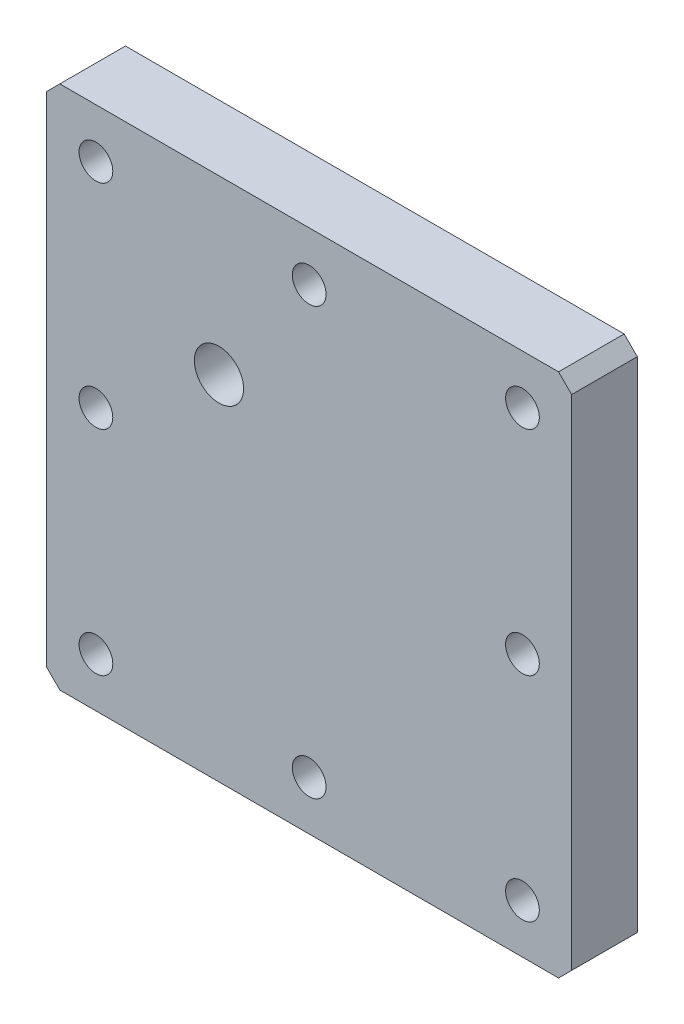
ISO-10303-21;
HEADER;
FILE_DESCRIPTION(('STEP AP214'),'2;1');
FILE_NAME('part.step','',(''),(''),'','','');
FILE_SCHEMA(('AUTOMOTIVE_DESIGN { 1 0 10303 214 1 1 1 1 }'));
ENDSEC;
DATA;
#1=APPLICATION_CONTEXT('core data for automotive mechanical design processes');
#2=APPLICATION_PROTOCOL_DEFINITION('international standard','automotive_design',2000,#1);
#3=PRODUCT_CONTEXT('',#1,'mechanical');
#4=PRODUCT('Part','Part','',(#3));
#5=PRODUCT_RELATED_PRODUCT_CATEGORY('part','',(#4));
#6=PRODUCT_DEFINITION_FORMATION('','',#4);
#7=PRODUCT_DEFINITION_CONTEXT('part definition',#1,'design');
#8=PRODUCT_DEFINITION('design','',#6,#7);
#9=PRODUCT_DEFINITION_SHAPE('','',#8);
#10=(LENGTH_UNIT() NAMED_UNIT(*) SI_UNIT(.MILLI.,.METRE.));
#11=(NAMED_UNIT(*) PLANE_ANGLE_UNIT() SI_UNIT($,.RADIAN.));
#12=(NAMED_UNIT(*) SI_UNIT($,.STERADIAN.) SOLID_ANGLE_UNIT());
#13=UNCERTAINTY_MEASURE_WITH_UNIT(LENGTH_MEASURE(1.E-05),#10,'distance_accuracy_value','');
#14=(GEOMETRIC_REPRESENTATION_CONTEXT(3) GLOBAL_UNCERTAINTY_ASSIGNED_CONTEXT((#13)) GLOBAL_UNIT_ASSIGNED_CONTEXT((#10,
#11,#12)) REPRESENTATION_CONTEXT('',''));
#15=CARTESIAN_POINT('',(0.,0.,0.));
#16=DIRECTION('',(0.,0.,1.));
#17=DIRECTION('',(1.,0.,0.));
#18=AXIS2_PLACEMENT_3D('',#15,#16,#17);
#19=CARTESIAN_POINT('',(-50.8,0.,12.7));
#20=DIRECTION('',(-1.,0.,0.));
#21=DIRECTION('',(0.,0.,1.));
#22=AXIS2_PLACEMENT_3D('',#19,#20,#21);
#23=PLANE('',#22);
#24=DIRECTION('',(0.,1.,0.));
#25=VECTOR('',#24,1.);
#26=CARTESIAN_POINT('',(-50.8,0.,0.));
#27=LINE('',#26,#25);
#28=CARTESIAN_POINT('',(-50.8,-48.26,0.));
#29=VERTEX_POINT('',#28);
#30=CARTESIAN_POINT('',(-50.8,48.26,0.));
#31=VERTEX_POINT('',#30);
#32=EDGE_CURVE('E159',#29,#31,#27,.T.);
#33=ORIENTED_EDGE('',*,*,#32,.F.);
#34=DIRECTION('',(0.,0.,-1.));
#35=VECTOR('',#34,1.);
#36=CARTESIAN_POINT('',(-50.8,-48.26,12.7));
#37=LINE('',#36,#35);
#38=CARTESIAN_POINT('',(-50.8,-48.26,12.7));
#39=VERTEX_POINT('',#38);
#40=EDGE_CURVE('E11',#39,#29,#37,.T.);
#41=ORIENTED_EDGE('',*,*,#40,.F.);
#42=DIRECTION('',(0.,1.,0.));
#43=VECTOR('',#42,1.);
#44=CARTESIAN_POINT('',(-50.8,0.,12.7));
#45=LINE('',#44,#43);
#46=CARTESIAN_POINT('',(-50.8,48.26,12.7));
#47=VERTEX_POINT('',#46);
#48=EDGE_CURVE('E453',#39,#47,#45,.T.);
#49=ORIENTED_EDGE('',*,*,#48,.T.);
#50=DIRECTION('',(0.,0.,-1.));
#51=VECTOR('',#50,1.);
#52=CARTESIAN_POINT('',(-50.8,48.26,12.7));
#53=LINE('',#52,#51);
#54=EDGE_CURVE('E55',#47,#31,#53,.T.);
#55=ORIENTED_EDGE('',*,*,#54,.T.);
#56=EDGE_LOOP('',(#33,#41,#49,#55));
#57=FACE_BOUND('',#56,.T.);
#58=ADVANCED_FACE('F38',(#57),#23,.T.);
#59=CARTESIAN_POINT('',(-49.53,-49.53,12.7));
#60=DIRECTION('',(0.707106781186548,0.707106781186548,0.));
#61=DIRECTION('',(-0.707106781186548,0.707106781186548,0.));
#62=AXIS2_PLACEMENT_3D('',#59,#60,#61);
#63=PLANE('',#62);
#64=DIRECTION('',(0.707106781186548,-0.707106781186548,0.));
#65=VECTOR('',#64,1.);
#66=CARTESIAN_POINT('',(-49.53,-49.53,0.));
#67=LINE('',#66,#65);
#68=CARTESIAN_POINT('',(-48.26,-50.8,0.));
#69=VERTEX_POINT('',#68);
#70=EDGE_CURVE('E161',#29,#69,#67,.T.);
#71=ORIENTED_EDGE('',*,*,#70,.T.);
#72=DIRECTION('',(0.,0.,-1.));
#73=VECTOR('',#72,1.);
#74=CARTESIAN_POINT('',(-48.26,-50.8,12.7));
#75=LINE('',#74,#73);
#76=CARTESIAN_POINT('',(-48.26,-50.8,12.7));
#77=VERTEX_POINT('',#76);
#78=EDGE_CURVE('E47',#77,#69,#75,.T.);
#79=ORIENTED_EDGE('',*,*,#78,.F.);
#80=DIRECTION('',(0.707106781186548,-0.707106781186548,0.));
#81=VECTOR('',#80,1.);
#82=CARTESIAN_POINT('',(-49.53,-49.53,12.7));
#83=LINE('',#82,#81);
#84=EDGE_CURVE('E449',#39,#77,#83,.T.);
#85=ORIENTED_EDGE('',*,*,#84,.F.);
#86=ORIENTED_EDGE('',*,*,#40,.T.);
#87=EDGE_LOOP('',(#71,#79,#85,#86));
#88=FACE_BOUND('',#87,.T.);
#89=ADVANCED_FACE('F198',(#88),#63,.F.);
#90=CARTESIAN_POINT('',(0.,-50.8,12.7));
#91=DIRECTION('',(0.,1.,0.));
#92=DIRECTION('',(0.,0.,1.));
#93=AXIS2_PLACEMENT_3D('',#90,#91,#92);
#94=PLANE('',#93);
#95=DIRECTION('',(1.,0.,0.));
#96=VECTOR('',#95,1.);
#97=CARTESIAN_POINT('',(0.,-50.8,0.));
#98=LINE('',#97,#96);
#99=CARTESIAN_POINT('',(48.26,-50.8,0.));
#100=VERTEX_POINT('',#99);
#101=EDGE_CURVE('E164',#69,#100,#98,.T.);
#102=ORIENTED_EDGE('',*,*,#101,.T.);
#103=DIRECTION('',(0.,0.,-1.));
#104=VECTOR('',#103,1.);
#105=CARTESIAN_POINT('',(48.26,-50.8,12.7));
#106=LINE('',#105,#104);
#107=CARTESIAN_POINT('',(48.26,-50.8,12.7));
#108=VERTEX_POINT('',#107);
#109=EDGE_CURVE('E186',#108,#100,#106,.T.);
#110=ORIENTED_EDGE('',*,*,#109,.F.);
#111=DIRECTION('',(1.,0.,0.));
#112=VECTOR('',#111,1.);
#113=CARTESIAN_POINT('',(0.,-50.8,12.7));
#114=LINE('',#113,#112);
#115=EDGE_CURVE('E194',#77,#108,#114,.T.);
#116=ORIENTED_EDGE('',*,*,#115,.F.);
#117=ORIENTED_EDGE('',*,*,#78,.T.);
#118=EDGE_LOOP('',(#102,#110,#116,#117));
#119=FACE_BOUND('',#118,.T.);
#120=ADVANCED_FACE('F191',(#119),#94,.F.);
#121=CARTESIAN_POINT('',(49.53,-49.53,12.7));
#122=DIRECTION('',(-0.707106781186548,0.707106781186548,0.));
#123=DIRECTION('',(-0.707106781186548,-0.707106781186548,0.));
#124=AXIS2_PLACEMENT_3D('',#121,#122,#123);
#125=PLANE('',#124);
#126=DIRECTION('',(0.707106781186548,0.707106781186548,0.));
#127=VECTOR('',#126,1.);
#128=CARTESIAN_POINT('',(49.53,-49.53,0.));
#129=LINE('',#128,#127);
#130=CARTESIAN_POINT('',(50.8,-48.26,0.));
#131=VERTEX_POINT('',#130);
#132=EDGE_CURVE('E167',#100,#131,#129,.T.);
#133=ORIENTED_EDGE('',*,*,#132,.T.);
#134=DIRECTION('',(0.,0.,-1.));
#135=VECTOR('',#134,1.);
#136=CARTESIAN_POINT('',(50.8,-48.26,12.7));
#137=LINE('',#136,#135);
#138=CARTESIAN_POINT('',(50.8,-48.26,12.7));
#139=VERTEX_POINT('',#138);
#140=EDGE_CURVE('E183',#139,#131,#137,.T.);
#141=ORIENTED_EDGE('',*,*,#140,.F.);
#142=DIRECTION('',(0.707106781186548,0.707106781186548,0.));
#143=VECTOR('',#142,1.);
#144=CARTESIAN_POINT('',(49.53,-49.53,12.7));
#145=LINE('',#144,#143);
#146=EDGE_CURVE('E447',#108,#139,#145,.T.);
#147=ORIENTED_EDGE('',*,*,#146,.F.);
#148=ORIENTED_EDGE('',*,*,#109,.T.);
#149=EDGE_LOOP('',(#133,#141,#147,#148));
#150=FACE_BOUND('',#149,.T.);
#151=ADVANCED_FACE('F289',(#150),#125,.F.);
#152=CARTESIAN_POINT('',(50.8,0.,12.7));
#153=DIRECTION('',(-1.,0.,0.));
#154=DIRECTION('',(0.,0.,1.));
#155=AXIS2_PLACEMENT_3D('',#152,#153,#154);
#156=PLANE('',#155);
#157=DIRECTION('',(0.,1.,0.));
#158=VECTOR('',#157,1.);
#159=CARTESIAN_POINT('',(50.8,0.,0.));
#160=LINE('',#159,#158);
#161=CARTESIAN_POINT('',(50.8,48.26,0.));
#162=VERTEX_POINT('',#161);
#163=EDGE_CURVE('E170',#131,#162,#160,.T.);
#164=ORIENTED_EDGE('',*,*,#163,.T.);
#165=DIRECTION('',(0.,0.,-1.));
#166=VECTOR('',#165,1.);
#167=CARTESIAN_POINT('',(50.8,48.26,12.7));
#168=LINE('',#167,#166);
#169=CARTESIAN_POINT('',(50.8,48.26,12.7));
#170=VERTEX_POINT('',#169);
#171=EDGE_CURVE('E114',#170,#162,#168,.T.);
#172=ORIENTED_EDGE('',*,*,#171,.F.);
#173=DIRECTION('',(0.,1.,0.));
#174=VECTOR('',#173,1.);
#175=CARTESIAN_POINT('',(50.8,0.,12.7));
#176=LINE('',#175,#174);
#177=EDGE_CURVE('E123',#139,#170,#176,.T.);
#178=ORIENTED_EDGE('',*,*,#177,.F.);
#179=ORIENTED_EDGE('',*,*,#140,.T.);
#180=EDGE_LOOP('',(#164,#172,#178,#179));
#181=FACE_BOUND('',#180,.T.);
#182=ADVANCED_FACE('F286',(#181),#156,.F.);
#183=CARTESIAN_POINT('',(49.53,49.53,12.7));
#184=DIRECTION('',(0.707106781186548,0.707106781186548,0.));
#185=DIRECTION('',(-0.707106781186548,0.707106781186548,0.));
#186=AXIS2_PLACEMENT_3D('',#183,#184,#185);
#187=PLANE('',#186);
#188=DIRECTION('',(0.707106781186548,-0.707106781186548,0.));
#189=VECTOR('',#188,1.);
#190=CARTESIAN_POINT('',(49.53,49.53,0.));
#191=LINE('',#190,#189);
#192=CARTESIAN_POINT('',(48.26,50.8,0.));
#193=VERTEX_POINT('',#192);
#194=EDGE_CURVE('E110',#193,#162,#191,.T.);
#195=ORIENTED_EDGE('',*,*,#194,.F.);
#196=DIRECTION('',(0.,0.,-1.));
#197=VECTOR('',#196,1.);
#198=CARTESIAN_POINT('',(48.26,50.8,12.7));
#199=LINE('',#198,#197);
#200=CARTESIAN_POINT('',(48.26,50.8,12.7));
#201=VERTEX_POINT('',#200);
#202=EDGE_CURVE('E105',#201,#193,#199,.T.);
#203=ORIENTED_EDGE('',*,*,#202,.F.);
#204=DIRECTION('',(0.707106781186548,-0.707106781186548,0.));
#205=VECTOR('',#204,1.);
#206=CARTESIAN_POINT('',(49.53,49.53,12.7));
#207=LINE('',#206,#205);
#208=EDGE_CURVE('E108',#201,#170,#207,.T.);
#209=ORIENTED_EDGE('',*,*,#208,.T.);
#210=ORIENTED_EDGE('',*,*,#171,.T.);
#211=EDGE_LOOP('',(#195,#203,#209,#210));
#212=FACE_BOUND('',#211,.T.);
#213=ADVANCED_FACE('F107',(#212),#187,.T.);
#214=CARTESIAN_POINT('',(0.,50.8,12.7));
#215=DIRECTION('',(0.,1.,0.));
#216=DIRECTION('',(0.,0.,1.));
#217=AXIS2_PLACEMENT_3D('',#214,#215,#216);
#218=PLANE('',#217);
#219=DIRECTION('',(1.,0.,0.));
#220=VECTOR('',#219,1.);
#221=CARTESIAN_POINT('',(0.,50.8,0.));
#222=LINE('',#221,#220);
#223=CARTESIAN_POINT('',(-48.26,50.8,0.));
#224=VERTEX_POINT('',#223);
#225=EDGE_CURVE('E174',#224,#193,#222,.T.);
#226=ORIENTED_EDGE('',*,*,#225,.F.);
#227=DIRECTION('',(0.,0.,-1.));
#228=VECTOR('',#227,1.);
#229=CARTESIAN_POINT('',(-48.26,50.8,12.7));
#230=LINE('',#229,#228);
#231=CARTESIAN_POINT('',(-48.26,50.8,12.7));
#232=VERTEX_POINT('',#231);
#233=EDGE_CURVE('E80',#232,#224,#230,.T.);
#234=ORIENTED_EDGE('',*,*,#233,.F.);
#235=DIRECTION('',(1.,0.,0.));
#236=VECTOR('',#235,1.);
#237=CARTESIAN_POINT('',(0.,50.8,12.7));
#238=LINE('',#237,#236);
#239=EDGE_CURVE('E121',#232,#201,#238,.T.);
#240=ORIENTED_EDGE('',*,*,#239,.T.);
#241=ORIENTED_EDGE('',*,*,#202,.T.);
#242=EDGE_LOOP('',(#226,#234,#240,#241));
#243=FACE_BOUND('',#242,.T.);
#244=ADVANCED_FACE('F126',(#243),#218,.T.);
#245=CARTESIAN_POINT('',(-41.275,41.275,12.7));
#246=DIRECTION('',(0.,0.,-1.));
#247=DIRECTION('',(-1.,0.,0.));
#248=AXIS2_PLACEMENT_3D('',#245,#246,#247);
#249=CYLINDRICAL_SURFACE('',#248,3.2639);
#250=CARTESIAN_POINT('',(-41.275,41.275,12.7));
#251=DIRECTION('',(0.,0.,1.));
#252=DIRECTION('',(1.,0.,0.));
#253=AXIS2_PLACEMENT_3D('',#250,#251,#252);
#254=CIRCLE('',#253,3.2639);
#255=CARTESIAN_POINT('',(-38.0111,41.275,12.7));
#256=VERTEX_POINT('',#255);
#257=EDGE_CURVE('E455',#256,#256,#254,.T.);
#258=ORIENTED_EDGE('',*,*,#257,.T.);
#259=EDGE_LOOP('',(#258));
#260=FACE_BOUND('',#259,.T.);
#261=CARTESIAN_POINT('',(-41.275,41.275,0.));
#262=DIRECTION('',(0.,0.,1.));
#263=DIRECTION('',(1.,0.,0.));
#264=AXIS2_PLACEMENT_3D('',#261,#262,#263);
#265=CIRCLE('',#264,3.2639);
#266=CARTESIAN_POINT('',(-38.0111,41.275,0.));
#267=VERTEX_POINT('',#266);
#268=EDGE_CURVE('E156',#267,#267,#265,.T.);
#269=ORIENTED_EDGE('',*,*,#268,.F.);
#270=EDGE_LOOP('',(#269));
#271=FACE_BOUND('',#270,.T.);
#272=ADVANCED_FACE('F209',(#260,#271),#249,.F.);
#273=CARTESIAN_POINT('',(41.275,41.275,12.7));
#274=DIRECTION('',(0.,0.,-1.));
#275=DIRECTION('',(-1.,0.,0.));
#276=AXIS2_PLACEMENT_3D('',#273,#274,#275);
#277=CYLINDRICAL_SURFACE('',#276,3.2639);
#278=CARTESIAN_POINT('',(41.275,41.275,12.7));
#279=DIRECTION('',(0.,0.,1.));
#280=DIRECTION('',(1.,0.,0.));
#281=AXIS2_PLACEMENT_3D('',#278,#279,#280);
#282=CIRCLE('',#281,3.2639);
#283=CARTESIAN_POINT('',(44.5389,41.275,12.7));
#284=VERTEX_POINT('',#283);
#285=EDGE_CURVE('E458',#284,#284,#282,.T.);
#286=ORIENTED_EDGE('',*,*,#285,.T.);
#287=EDGE_LOOP('',(#286));
#288=FACE_BOUND('',#287,.T.);
#289=CARTESIAN_POINT('',(41.275,41.275,0.));
#290=DIRECTION('',(0.,0.,1.));
#291=DIRECTION('',(1.,0.,0.));
#292=AXIS2_PLACEMENT_3D('',#289,#290,#291);
#293=CIRCLE('',#292,3.2639);
#294=CARTESIAN_POINT('',(44.5389,41.275,0.));
#295=VERTEX_POINT('',#294);
#296=EDGE_CURVE('E153',#295,#295,#293,.T.);
#297=ORIENTED_EDGE('',*,*,#296,.F.);
#298=EDGE_LOOP('',(#297));
#299=FACE_BOUND('',#298,.T.);
#300=ADVANCED_FACE('F212',(#288,#299),#277,.F.);
#301=CARTESIAN_POINT('',(41.275,0.,12.7));
#302=DIRECTION('',(0.,0.,-1.));
#303=DIRECTION('',(-1.,0.,0.));
#304=AXIS2_PLACEMENT_3D('',#301,#302,#303);
#305=CYLINDRICAL_SURFACE('',#304,3.2639);
#306=CARTESIAN_POINT('',(41.275,0.,12.7));
#307=DIRECTION('',(0.,0.,1.));
#308=DIRECTION('',(1.,0.,0.));
#309=AXIS2_PLACEMENT_3D('',#306,#307,#308);
#310=CIRCLE('',#309,3.2639);
#311=CARTESIAN_POINT('',(44.5389,0.,12.7));
#312=VERTEX_POINT('',#311);
#313=EDGE_CURVE('E461',#312,#312,#310,.T.);
#314=ORIENTED_EDGE('',*,*,#313,.T.);
#315=EDGE_LOOP('',(#314));
#316=FACE_BOUND('',#315,.T.);
#317=CARTESIAN_POINT('',(41.275,0.,0.));
#318=DIRECTION('',(0.,0.,1.));
#319=DIRECTION('',(1.,0.,0.));
#320=AXIS2_PLACEMENT_3D('',#317,#318,#319);
#321=CIRCLE('',#320,3.2639);
#322=CARTESIAN_POINT('',(44.5389,0.,0.));
#323=VERTEX_POINT('',#322);
#324=EDGE_CURVE('E150',#323,#323,#321,.T.);
#325=ORIENTED_EDGE('',*,*,#324,.F.);
#326=EDGE_LOOP('',(#325));
#327=FACE_BOUND('',#326,.T.);
#328=ADVANCED_FACE('F216',(#316,#327),#305,.F.);
#329=CARTESIAN_POINT('',(41.275,-41.275,12.7));
#330=DIRECTION('',(0.,0.,-1.));
#331=DIRECTION('',(-1.,0.,0.));
#332=AXIS2_PLACEMENT_3D('',#329,#330,#331);
#333=CYLINDRICAL_SURFACE('',#332,3.2639);
#334=CARTESIAN_POINT('',(41.275,-41.275,12.7));
#335=DIRECTION('',(0.,0.,1.));
#336=DIRECTION('',(1.,0.,0.));
#337=AXIS2_PLACEMENT_3D('',#334,#335,#336);
#338=CIRCLE('',#337,3.2639);
#339=CARTESIAN_POINT('',(44.5389,-41.275,12.7));
#340=VERTEX_POINT('',#339);
#341=EDGE_CURVE('E464',#340,#340,#338,.T.);
#342=ORIENTED_EDGE('',*,*,#341,.T.);
#343=EDGE_LOOP('',(#342));
#344=FACE_BOUND('',#343,.T.);
#345=CARTESIAN_POINT('',(41.275,-41.275,0.));
#346=DIRECTION('',(0.,0.,1.));
#347=DIRECTION('',(1.,0.,0.));
#348=AXIS2_PLACEMENT_3D('',#345,#346,#347);
#349=CIRCLE('',#348,3.2639);
#350=CARTESIAN_POINT('',(44.5389,-41.275,0.));
#351=VERTEX_POINT('',#350);
#352=EDGE_CURVE('E147',#351,#351,#349,.T.);
#353=ORIENTED_EDGE('',*,*,#352,.F.);
#354=EDGE_LOOP('',(#353));
#355=FACE_BOUND('',#354,.T.);
#356=ADVANCED_FACE('F220',(#344,#355),#333,.F.);
#357=CARTESIAN_POINT('',(-41.275,-41.275,12.7));
#358=DIRECTION('',(0.,0.,-1.));
#359=DIRECTION('',(-1.,0.,0.));
#360=AXIS2_PLACEMENT_3D('',#357,#358,#359);
#361=CYLINDRICAL_SURFACE('',#360,3.2639);
#362=CARTESIAN_POINT('',(-41.275,-41.275,12.7));
#363=DIRECTION('',(0.,0.,1.));
#364=DIRECTION('',(1.,0.,0.));
#365=AXIS2_PLACEMENT_3D('',#362,#363,#364);
#366=CIRCLE('',#365,3.2639);
#367=CARTESIAN_POINT('',(-38.0111,-41.275,12.7));
#368=VERTEX_POINT('',#367);
#369=EDGE_CURVE('E467',#368,#368,#366,.T.);
#370=ORIENTED_EDGE('',*,*,#369,.T.);
#371=EDGE_LOOP('',(#370));
#372=FACE_BOUND('',#371,.T.);
#373=CARTESIAN_POINT('',(-41.275,-41.275,0.));
#374=DIRECTION('',(0.,0.,1.));
#375=DIRECTION('',(1.,0.,0.));
#376=AXIS2_PLACEMENT_3D('',#373,#374,#375);
#377=CIRCLE('',#376,3.2639);
#378=CARTESIAN_POINT('',(-38.0111,-41.275,0.));
#379=VERTEX_POINT('',#378);
#380=EDGE_CURVE('E144',#379,#379,#377,.T.);
#381=ORIENTED_EDGE('',*,*,#380,.F.);
#382=EDGE_LOOP('',(#381));
#383=FACE_BOUND('',#382,.T.);
#384=ADVANCED_FACE('F224',(#372,#383),#361,.F.);
#385=CARTESIAN_POINT('',(-41.275,0.,12.7));
#386=DIRECTION('',(0.,0.,-1.));
#387=DIRECTION('',(-1.,0.,0.));
#388=AXIS2_PLACEMENT_3D('',#385,#386,#387);
#389=CYLINDRICAL_SURFACE('',#388,3.2639);
#390=CARTESIAN_POINT('',(-41.275,0.,12.7));
#391=DIRECTION('',(0.,0.,1.));
#392=DIRECTION('',(1.,0.,0.));
#393=AXIS2_PLACEMENT_3D('',#390,#391,#392);
#394=CIRCLE('',#393,3.2639);
#395=CARTESIAN_POINT('',(-38.0111,0.,12.7));
#396=VERTEX_POINT('',#395);
#397=EDGE_CURVE('E470',#396,#396,#394,.T.);
#398=ORIENTED_EDGE('',*,*,#397,.T.);
#399=EDGE_LOOP('',(#398));
#400=FACE_BOUND('',#399,.T.);
#401=CARTESIAN_POINT('',(-41.275,0.,0.));
#402=DIRECTION('',(0.,0.,1.));
#403=DIRECTION('',(1.,0.,0.));
#404=AXIS2_PLACEMENT_3D('',#401,#402,#403);
#405=CIRCLE('',#404,3.2639);
#406=CARTESIAN_POINT('',(-38.0111,0.,0.));
#407=VERTEX_POINT('',#406);
#408=EDGE_CURVE('E141',#407,#407,#405,.T.);
#409=ORIENTED_EDGE('',*,*,#408,.F.);
#410=EDGE_LOOP('',(#409));
#411=FACE_BOUND('',#410,.T.);
#412=ADVANCED_FACE('F228',(#400,#411),#389,.F.);
#413=CARTESIAN_POINT('',(0.,41.275,12.7));
#414=DIRECTION('',(0.,0.,-1.));
#415=DIRECTION('',(-1.,0.,0.));
#416=AXIS2_PLACEMENT_3D('',#413,#414,#415);
#417=CYLINDRICAL_SURFACE('',#416,3.2639);
#418=CARTESIAN_POINT('',(0.,41.275,12.7));
#419=DIRECTION('',(0.,0.,1.));
#420=DIRECTION('',(1.,0.,0.));
#421=AXIS2_PLACEMENT_3D('',#418,#419,#420);
#422=CIRCLE('',#421,3.2639);
#423=CARTESIAN_POINT('',(3.2639,41.275,12.7));
#424=VERTEX_POINT('',#423);
#425=EDGE_CURVE('E473',#424,#424,#422,.T.);
#426=ORIENTED_EDGE('',*,*,#425,.T.);
#427=EDGE_LOOP('',(#426));
#428=FACE_BOUND('',#427,.T.);
#429=CARTESIAN_POINT('',(0.,41.275,0.));
#430=DIRECTION('',(0.,0.,1.));
#431=DIRECTION('',(1.,0.,0.));
#432=AXIS2_PLACEMENT_3D('',#429,#430,#431);
#433=CIRCLE('',#432,3.2639);
#434=CARTESIAN_POINT('',(3.2639,41.275,0.));
#435=VERTEX_POINT('',#434);
#436=EDGE_CURVE('E138',#435,#435,#433,.T.);
#437=ORIENTED_EDGE('',*,*,#436,.F.);
#438=EDGE_LOOP('',(#437));
#439=FACE_BOUND('',#438,.T.);
#440=ADVANCED_FACE('F232',(#428,#439),#417,.F.);
#441=CARTESIAN_POINT('',(0.,-41.275,12.7));
#442=DIRECTION('',(0.,0.,-1.));
#443=DIRECTION('',(-1.,0.,0.));
#444=AXIS2_PLACEMENT_3D('',#441,#442,#443);
#445=CYLINDRICAL_SURFACE('',#444,3.2639);
#446=CARTESIAN_POINT('',(0.,-41.275,12.7));
#447=DIRECTION('',(0.,0.,1.));
#448=DIRECTION('',(1.,0.,0.));
#449=AXIS2_PLACEMENT_3D('',#446,#447,#448);
#450=CIRCLE('',#449,3.2639);
#451=CARTESIAN_POINT('',(3.2639,-41.275,12.7));
#452=VERTEX_POINT('',#451);
#453=EDGE_CURVE('E247',#452,#452,#450,.T.);
#454=ORIENTED_EDGE('',*,*,#453,.T.);
#455=EDGE_LOOP('',(#454));
#456=FACE_BOUND('',#455,.T.);
#457=CARTESIAN_POINT('',(0.,-41.275,0.));
#458=DIRECTION('',(0.,0.,1.));
#459=DIRECTION('',(1.,0.,0.));
#460=AXIS2_PLACEMENT_3D('',#457,#458,#459);
#461=CIRCLE('',#460,3.2639);
#462=CARTESIAN_POINT('',(3.2639,-41.275,0.));
#463=VERTEX_POINT('',#462);
#464=EDGE_CURVE('E135',#463,#463,#461,.T.);
#465=ORIENTED_EDGE('',*,*,#464,.F.);
#466=EDGE_LOOP('',(#465));
#467=FACE_BOUND('',#466,.T.);
#468=ADVANCED_FACE('F235',(#456,#467),#445,.F.);
#469=CARTESIAN_POINT('',(-17.4625,17.4625,12.7));
#470=DIRECTION('',(0.,0.,-1.));
#471=DIRECTION('',(-1.,0.,0.));
#472=AXIS2_PLACEMENT_3D('',#469,#470,#471);
#473=CYLINDRICAL_SURFACE('',#472,4.7625);
#474=CARTESIAN_POINT('',(-17.4625,17.4625,12.7));
#475=DIRECTION('',(0.,0.,1.));
#476=DIRECTION('',(1.,0.,0.));
#477=AXIS2_PLACEMENT_3D('',#474,#475,#476);
#478=CIRCLE('',#477,4.7625);
#479=CARTESIAN_POINT('',(-12.7,17.4625,12.7));
#480=VERTEX_POINT('',#479);
#481=EDGE_CURVE('E179',#480,#480,#478,.T.);
#482=ORIENTED_EDGE('',*,*,#481,.T.);
#483=EDGE_LOOP('',(#482));
#484=FACE_BOUND('',#483,.T.);
#485=CARTESIAN_POINT('',(-17.4625,17.4625,0.));
#486=DIRECTION('',(0.,0.,1.));
#487=DIRECTION('',(1.,0.,0.));
#488=AXIS2_PLACEMENT_3D('',#485,#486,#487);
#489=CIRCLE('',#488,4.7625);
#490=CARTESIAN_POINT('',(-12.7,17.4625,0.));
#491=VERTEX_POINT('',#490);
#492=EDGE_CURVE('E132',#491,#491,#489,.T.);
#493=ORIENTED_EDGE('',*,*,#492,.F.);
#494=EDGE_LOOP('',(#493));
#495=FACE_BOUND('',#494,.T.);
#496=ADVANCED_FACE('F40',(#484,#495),#473,.F.);
#497=CARTESIAN_POINT('',(-49.53,49.53,12.7));
#498=DIRECTION('',(-0.707106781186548,0.707106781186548,0.));
#499=DIRECTION('',(-0.707106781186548,-0.707106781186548,0.));
#500=AXIS2_PLACEMENT_3D('',#497,#498,#499);
#501=PLANE('',#500);
#502=DIRECTION('',(0.707106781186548,0.707106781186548,0.));
#503=VECTOR('',#502,1.);
#504=CARTESIAN_POINT('',(-49.53,49.53,0.));
#505=LINE('',#504,#503);
#506=EDGE_CURVE('E176',#31,#224,#505,.T.);
#507=ORIENTED_EDGE('',*,*,#506,.F.);
#508=ORIENTED_EDGE('',*,*,#54,.F.);
#509=DIRECTION('',(0.707106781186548,0.707106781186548,0.));
#510=VECTOR('',#509,1.);
#511=CARTESIAN_POINT('',(-49.53,49.53,12.7));
#512=LINE('',#511,#510);
#513=EDGE_CURVE('E127',#47,#232,#512,.T.);
#514=ORIENTED_EDGE('',*,*,#513,.T.);
#515=ORIENTED_EDGE('',*,*,#233,.T.);
#516=EDGE_LOOP('',(#507,#508,#514,#515));
#517=FACE_BOUND('',#516,.T.);
#518=ADVANCED_FACE('F242',(#517),#501,.T.);
#519=CARTESIAN_POINT('',(0.,0.,12.7));
#520=DIRECTION('',(0.,0.,1.));
#521=DIRECTION('',(1.,0.,0.));
#522=AXIS2_PLACEMENT_3D('',#519,#520,#521);
#523=PLANE('',#522);
#524=ORIENTED_EDGE('',*,*,#481,.F.);
#525=EDGE_LOOP('',(#524));
#526=FACE_BOUND('',#525,.T.);
#527=ORIENTED_EDGE('',*,*,#453,.F.);
#528=EDGE_LOOP('',(#527));
#529=FACE_BOUND('',#528,.T.);
#530=ORIENTED_EDGE('',*,*,#425,.F.);
#531=EDGE_LOOP('',(#530));
#532=FACE_BOUND('',#531,.T.);
#533=ORIENTED_EDGE('',*,*,#397,.F.);
#534=EDGE_LOOP('',(#533));
#535=FACE_BOUND('',#534,.T.);
#536=ORIENTED_EDGE('',*,*,#369,.F.);
#537=EDGE_LOOP('',(#536));
#538=FACE_BOUND('',#537,.T.);
#539=ORIENTED_EDGE('',*,*,#341,.F.);
#540=EDGE_LOOP('',(#539));
#541=FACE_BOUND('',#540,.T.);
#542=ORIENTED_EDGE('',*,*,#313,.F.);
#543=EDGE_LOOP('',(#542));
#544=FACE_BOUND('',#543,.T.);
#545=ORIENTED_EDGE('',*,*,#285,.F.);
#546=EDGE_LOOP('',(#545));
#547=FACE_BOUND('',#546,.T.);
#548=ORIENTED_EDGE('',*,*,#257,.F.);
#549=EDGE_LOOP('',(#548));
#550=FACE_BOUND('',#549,.T.);
#551=ORIENTED_EDGE('',*,*,#48,.F.);
#552=ORIENTED_EDGE('',*,*,#84,.T.);
#553=ORIENTED_EDGE('',*,*,#115,.T.);
#554=ORIENTED_EDGE('',*,*,#146,.T.);
#555=ORIENTED_EDGE('',*,*,#177,.T.);
#556=ORIENTED_EDGE('',*,*,#208,.F.);
#557=ORIENTED_EDGE('',*,*,#239,.F.);
#558=ORIENTED_EDGE('',*,*,#513,.F.);
#559=EDGE_LOOP('',(#551,#552,#553,#554,#555,#556,#557,#558));
#560=FACE_BOUND('',#559,.T.);
#561=ADVANCED_FACE('F119',(#526,#529,#532,#535,#538,#541,#544,#547,#550,#560),#523,.T.);
#562=CARTESIAN_POINT('',(0.,0.,0.));
#563=DIRECTION('',(0.,0.,1.));
#564=DIRECTION('',(1.,0.,0.));
#565=AXIS2_PLACEMENT_3D('',#562,#563,#564);
#566=PLANE('',#565);
#567=ORIENTED_EDGE('',*,*,#492,.T.);
#568=EDGE_LOOP('',(#567));
#569=FACE_BOUND('',#568,.T.);
#570=ORIENTED_EDGE('',*,*,#464,.T.);
#571=EDGE_LOOP('',(#570));
#572=FACE_BOUND('',#571,.T.);
#573=ORIENTED_EDGE('',*,*,#436,.T.);
#574=EDGE_LOOP('',(#573));
#575=FACE_BOUND('',#574,.T.);
#576=ORIENTED_EDGE('',*,*,#408,.T.);
#577=EDGE_LOOP('',(#576));
#578=FACE_BOUND('',#577,.T.);
#579=ORIENTED_EDGE('',*,*,#380,.T.);
#580=EDGE_LOOP('',(#579));
#581=FACE_BOUND('',#580,.T.);
#582=ORIENTED_EDGE('',*,*,#352,.T.);
#583=EDGE_LOOP('',(#582));
#584=FACE_BOUND('',#583,.T.);
#585=ORIENTED_EDGE('',*,*,#324,.T.);
#586=EDGE_LOOP('',(#585));
#587=FACE_BOUND('',#586,.T.);
#588=ORIENTED_EDGE('',*,*,#296,.T.);
#589=EDGE_LOOP('',(#588));
#590=FACE_BOUND('',#589,.T.);
#591=ORIENTED_EDGE('',*,*,#268,.T.);
#592=EDGE_LOOP('',(#591));
#593=FACE_BOUND('',#592,.T.);
#594=ORIENTED_EDGE('',*,*,#32,.T.);
#595=ORIENTED_EDGE('',*,*,#506,.T.);
#596=ORIENTED_EDGE('',*,*,#225,.T.);
#597=ORIENTED_EDGE('',*,*,#194,.T.);
#598=ORIENTED_EDGE('',*,*,#163,.F.);
#599=ORIENTED_EDGE('',*,*,#132,.F.);
#600=ORIENTED_EDGE('',*,*,#101,.F.);
#601=ORIENTED_EDGE('',*,*,#70,.F.);
#602=EDGE_LOOP('',(#594,#595,#596,#597,#598,#599,#600,#601));
#603=FACE_BOUND('',#602,.T.);
#604=ADVANCED_FACE('F200',(#569,#572,#575,#578,#581,#584,#587,#590,#593,#603),#566,.F.);
#605=CLOSED_SHELL('',(#58,#89,#120,#151,#182,#213,#244,#272,#300,#328,#356,#384,#412,#440,#468,
#496,#518,#561,#604));
#606=MANIFOLD_SOLID_BREP('B2',#605);
#607=ADVANCED_BREP_SHAPE_REPRESENTATION('',(#18,#606),#14);
#608=SHAPE_DEFINITION_REPRESENTATION(#9,#607);
ENDSEC;
END-ISO-10303-21;
